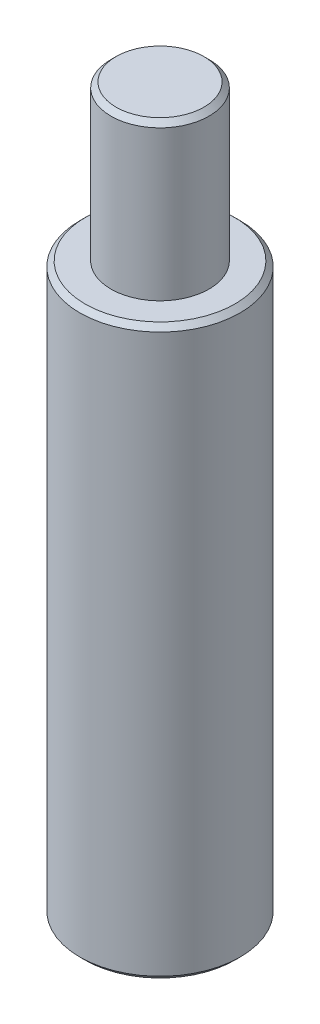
ISO-10303-21;
HEADER;
FILE_DESCRIPTION(('STEP AP214'),'2;1');
FILE_NAME('part.step','',(''),(''),'','','');
FILE_SCHEMA(('AUTOMOTIVE_DESIGN { 1 0 10303 214 1 1 1 1 }'));
ENDSEC;
DATA;
#1=APPLICATION_CONTEXT('core data for automotive mechanical design processes');
#2=APPLICATION_PROTOCOL_DEFINITION('international standard','automotive_design',2000,#1);
#3=PRODUCT_CONTEXT('',#1,'mechanical');
#4=PRODUCT('Part','Part','',(#3));
#5=PRODUCT_RELATED_PRODUCT_CATEGORY('part','',(#4));
#6=PRODUCT_DEFINITION_FORMATION('','',#4);
#7=PRODUCT_DEFINITION_CONTEXT('part definition',#1,'design');
#8=PRODUCT_DEFINITION('design','',#6,#7);
#9=PRODUCT_DEFINITION_SHAPE('','',#8);
#10=(LENGTH_UNIT() NAMED_UNIT(*) SI_UNIT(.MILLI.,.METRE.));
#11=(NAMED_UNIT(*) PLANE_ANGLE_UNIT() SI_UNIT($,.RADIAN.));
#12=(NAMED_UNIT(*) SI_UNIT($,.STERADIAN.) SOLID_ANGLE_UNIT());
#13=UNCERTAINTY_MEASURE_WITH_UNIT(LENGTH_MEASURE(1.E-05),#10,'distance_accuracy_value','');
#14=(GEOMETRIC_REPRESENTATION_CONTEXT(3) GLOBAL_UNCERTAINTY_ASSIGNED_CONTEXT((#13)) GLOBAL_UNIT_ASSIGNED_CONTEXT((#10,
#11,#12)) REPRESENTATION_CONTEXT('',''));
#15=CARTESIAN_POINT('',(0.,0.,0.));
#16=DIRECTION('',(0.,0.,1.));
#17=DIRECTION('',(1.,0.,0.));
#18=AXIS2_PLACEMENT_3D('',#15,#16,#17);
#19=CARTESIAN_POINT('',(0.,11.,0.));
#20=DIRECTION('',(0.,-1.,0.));
#21=DIRECTION('',(0.,0.,-1.));
#22=AXIS2_PLACEMENT_3D('',#19,#20,#21);
#23=CYLINDRICAL_SURFACE('',#22,1.55);
#24=CARTESIAN_POINT('',(0.,0.0999999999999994,0.));
#25=DIRECTION('',(0.,1.,0.));
#26=DIRECTION('',(0.,0.,1.));
#27=AXIS2_PLACEMENT_3D('',#24,#25,#26);
#28=CIRCLE('',#27,1.55);
#29=CARTESIAN_POINT('',(0.,0.0999999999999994,1.55));
#30=VERTEX_POINT('',#29);
#31=EDGE_CURVE('E64',#30,#30,#28,.T.);
#32=ORIENTED_EDGE('',*,*,#31,.T.);
#33=EDGE_LOOP('',(#32));
#34=FACE_BOUND('',#33,.T.);
#35=CARTESIAN_POINT('',(0.,10.9,0.));
#36=DIRECTION('',(0.,1.,0.));
#37=DIRECTION('',(0.,0.,1.));
#38=AXIS2_PLACEMENT_3D('',#35,#36,#37);
#39=CIRCLE('',#38,1.55);
#40=CARTESIAN_POINT('',(0.,10.9,1.55));
#41=VERTEX_POINT('',#40);
#42=EDGE_CURVE('E57',#41,#41,#39,.F.);
#43=ORIENTED_EDGE('',*,*,#42,.T.);
#44=EDGE_LOOP('',(#43));
#45=FACE_BOUND('',#44,.T.);
#46=ADVANCED_FACE('F33',(#34,#45),#23,.T.);
#47=CARTESIAN_POINT('',(0.,11.,0.));
#48=DIRECTION('',(0.,1.,0.));
#49=DIRECTION('',(0.,0.,1.));
#50=AXIS2_PLACEMENT_3D('',#47,#48,#49);
#51=PLANE('',#50);
#52=CARTESIAN_POINT('',(0.,11.,0.));
#53=DIRECTION('',(0.,1.,0.));
#54=DIRECTION('',(0.,0.,1.));
#55=AXIS2_PLACEMENT_3D('',#52,#53,#54);
#56=CIRCLE('',#55,1.45);
#57=CARTESIAN_POINT('',(0.,11.,1.45));
#58=VERTEX_POINT('',#57);
#59=EDGE_CURVE('E70',#58,#58,#56,.T.);
#60=ORIENTED_EDGE('',*,*,#59,.T.);
#61=EDGE_LOOP('',(#60));
#62=FACE_BOUND('',#61,.T.);
#63=CARTESIAN_POINT('',(0.,11.,0.));
#64=DIRECTION('',(0.,1.,0.));
#65=DIRECTION('',(0.,0.,1.));
#66=AXIS2_PLACEMENT_3D('',#63,#64,#65);
#67=CIRCLE('',#66,0.95);
#68=CARTESIAN_POINT('',(0.,11.,0.95));
#69=VERTEX_POINT('',#68);
#70=EDGE_CURVE('E53',#69,#69,#67,.T.);
#71=ORIENTED_EDGE('',*,*,#70,.F.);
#72=EDGE_LOOP('',(#71));
#73=FACE_BOUND('',#72,.T.);
#74=ADVANCED_FACE('F86',(#62,#73),#51,.T.);
#75=CARTESIAN_POINT('',(0.,0.,0.));
#76=DIRECTION('',(0.,1.,0.));
#77=DIRECTION('',(0.,0.,1.));
#78=AXIS2_PLACEMENT_3D('',#75,#76,#77);
#79=PLANE('',#78);
#80=CARTESIAN_POINT('',(0.,0.,0.));
#81=DIRECTION('',(0.,1.,0.));
#82=DIRECTION('',(0.,0.,1.));
#83=AXIS2_PLACEMENT_3D('',#80,#81,#82);
#84=CIRCLE('',#83,1.45);
#85=CARTESIAN_POINT('',(0.,0.,1.45));
#86=VERTEX_POINT('',#85);
#87=EDGE_CURVE('E67',#86,#86,#84,.F.);
#88=ORIENTED_EDGE('',*,*,#87,.T.);
#89=EDGE_LOOP('',(#88));
#90=FACE_BOUND('',#89,.T.);
#91=CARTESIAN_POINT('',(0.,0.,0.));
#92=DIRECTION('',(0.,-1.,0.));
#93=DIRECTION('',(0.,0.,-1.));
#94=AXIS2_PLACEMENT_3D('',#91,#92,#93);
#95=CIRCLE('',#94,0.79999999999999);
#96=CARTESIAN_POINT('',(0.,0.,-0.79999999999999));
#97=VERTEX_POINT('',#96);
#98=EDGE_CURVE('E54',#97,#97,#95,.T.);
#99=ORIENTED_EDGE('',*,*,#98,.F.);
#100=EDGE_LOOP('',(#99));
#101=FACE_BOUND('',#100,.T.);
#102=ADVANCED_FACE('F92',(#90,#101),#79,.F.);
#103=CARTESIAN_POINT('',(0.,14.,0.));
#104=DIRECTION('',(0.,-1.,0.));
#105=DIRECTION('',(0.,0.,-1.));
#106=AXIS2_PLACEMENT_3D('',#103,#104,#105);
#107=CYLINDRICAL_SURFACE('',#106,0.95);
#108=CARTESIAN_POINT('',(0.,13.9,0.));
#109=DIRECTION('',(0.,1.,0.));
#110=DIRECTION('',(0.,0.,1.));
#111=AXIS2_PLACEMENT_3D('',#108,#109,#110);
#112=CIRCLE('',#111,0.95);
#113=CARTESIAN_POINT('',(0.,13.9,0.95));
#114=VERTEX_POINT('',#113);
#115=EDGE_CURVE('E11',#114,#114,#112,.F.);
#116=ORIENTED_EDGE('',*,*,#115,.T.);
#117=EDGE_LOOP('',(#116));
#118=FACE_BOUND('',#117,.T.);
#119=ORIENTED_EDGE('',*,*,#70,.T.);
#120=EDGE_LOOP('',(#119));
#121=FACE_BOUND('',#120,.T.);
#122=ADVANCED_FACE('F110',(#118,#121),#107,.T.);
#123=CARTESIAN_POINT('',(0.,14.,0.));
#124=DIRECTION('',(0.,1.,0.));
#125=DIRECTION('',(0.,0.,1.));
#126=AXIS2_PLACEMENT_3D('',#123,#124,#125);
#127=PLANE('',#126);
#128=CARTESIAN_POINT('',(0.,14.,0.));
#129=DIRECTION('',(0.,1.,0.));
#130=DIRECTION('',(0.,0.,1.));
#131=AXIS2_PLACEMENT_3D('',#128,#129,#130);
#132=CIRCLE('',#131,0.850000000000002);
#133=CARTESIAN_POINT('',(0.,14.,0.850000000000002));
#134=VERTEX_POINT('',#133);
#135=EDGE_CURVE('E40',#134,#134,#132,.T.);
#136=ORIENTED_EDGE('',*,*,#135,.T.);
#137=EDGE_LOOP('',(#136));
#138=FACE_BOUND('',#137,.T.);
#139=ADVANCED_FACE('F47',(#138),#127,.T.);
#140=CARTESIAN_POINT('',(0.,8.,0.));
#141=DIRECTION('',(0.,-1.,0.));
#142=DIRECTION('',(0.,0.,-1.));
#143=AXIS2_PLACEMENT_3D('',#140,#141,#142);
#144=CONICAL_SURFACE('',#143,0.799999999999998,1.02974425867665);
#145=CARTESIAN_POINT('',(0.,8.48068849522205,0.));
#146=VERTEX_POINT('',#145);
#147=VERTEX_LOOP('',#146);
#148=FACE_BOUND('',#147,.T.);
#149=CARTESIAN_POINT('',(0.,8.,0.));
#150=DIRECTION('',(0.,-1.,0.));
#151=DIRECTION('',(0.,0.,-1.));
#152=AXIS2_PLACEMENT_3D('',#149,#150,#151);
#153=CIRCLE('',#152,0.799999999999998);
#154=CARTESIAN_POINT('',(0.,8.,-0.799999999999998));
#155=VERTEX_POINT('',#154);
#156=EDGE_CURVE('E51',#155,#155,#153,.T.);
#157=ORIENTED_EDGE('',*,*,#156,.T.);
#158=EDGE_LOOP('',(#157));
#159=FACE_BOUND('',#158,.T.);
#160=ADVANCED_FACE('F43',(#148,#159),#144,.F.);
#161=CARTESIAN_POINT('',(0.,0.,0.));
#162=DIRECTION('',(0.,-1.,0.));
#163=DIRECTION('',(0.,0.,-1.));
#164=AXIS2_PLACEMENT_3D('',#161,#162,#163);
#165=CYLINDRICAL_SURFACE('',#164,0.799999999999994);
#166=ORIENTED_EDGE('',*,*,#156,.F.);
#167=EDGE_LOOP('',(#166));
#168=FACE_BOUND('',#167,.T.);
#169=ORIENTED_EDGE('',*,*,#98,.T.);
#170=EDGE_LOOP('',(#169));
#171=FACE_BOUND('',#170,.T.);
#172=ADVANCED_FACE('F46',(#168,#171),#165,.F.);
#173=CARTESIAN_POINT('',(0.,0.0999999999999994,0.));
#174=DIRECTION('',(0.,1.,0.));
#175=DIRECTION('',(0.,0.,1.));
#176=AXIS2_PLACEMENT_3D('',#173,#174,#175);
#177=CONICAL_SURFACE('',#176,1.55,0.785398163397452);
#178=ORIENTED_EDGE('',*,*,#87,.F.);
#179=EDGE_LOOP('',(#178));
#180=FACE_BOUND('',#179,.T.);
#181=ORIENTED_EDGE('',*,*,#31,.F.);
#182=EDGE_LOOP('',(#181));
#183=FACE_BOUND('',#182,.T.);
#184=ADVANCED_FACE('F82',(#180,#183),#177,.T.);
#185=CARTESIAN_POINT('',(0.,11.,0.));
#186=DIRECTION('',(0.,-1.,0.));
#187=DIRECTION('',(0.,0.,-1.));
#188=AXIS2_PLACEMENT_3D('',#185,#186,#187);
#189=CONICAL_SURFACE('',#188,1.45,0.785398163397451);
#190=ORIENTED_EDGE('',*,*,#42,.F.);
#191=EDGE_LOOP('',(#190));
#192=FACE_BOUND('',#191,.T.);
#193=ORIENTED_EDGE('',*,*,#59,.F.);
#194=EDGE_LOOP('',(#193));
#195=FACE_BOUND('',#194,.T.);
#196=ADVANCED_FACE('F77',(#192,#195),#189,.T.);
#197=CARTESIAN_POINT('',(0.,14.,0.));
#198=DIRECTION('',(0.,-1.,0.));
#199=DIRECTION('',(0.,0.,-1.));
#200=AXIS2_PLACEMENT_3D('',#197,#198,#199);
#201=CONICAL_SURFACE('',#200,0.850000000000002,0.785398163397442);
#202=ORIENTED_EDGE('',*,*,#115,.F.);
#203=EDGE_LOOP('',(#202));
#204=FACE_BOUND('',#203,.T.);
#205=ORIENTED_EDGE('',*,*,#135,.F.);
#206=EDGE_LOOP('',(#205));
#207=FACE_BOUND('',#206,.T.);
#208=ADVANCED_FACE('F35',(#204,#207),#201,.T.);
#209=CLOSED_SHELL('',(#46,#74,#102,#122,#139,#160,#172,#184,#196,#208));
#210=MANIFOLD_SOLID_BREP('B2',#209);
#211=ADVANCED_BREP_SHAPE_REPRESENTATION('',(#18,#210),#14);
#212=SHAPE_DEFINITION_REPRESENTATION(#9,#211);
ENDSEC;
END-ISO-10303-21;
